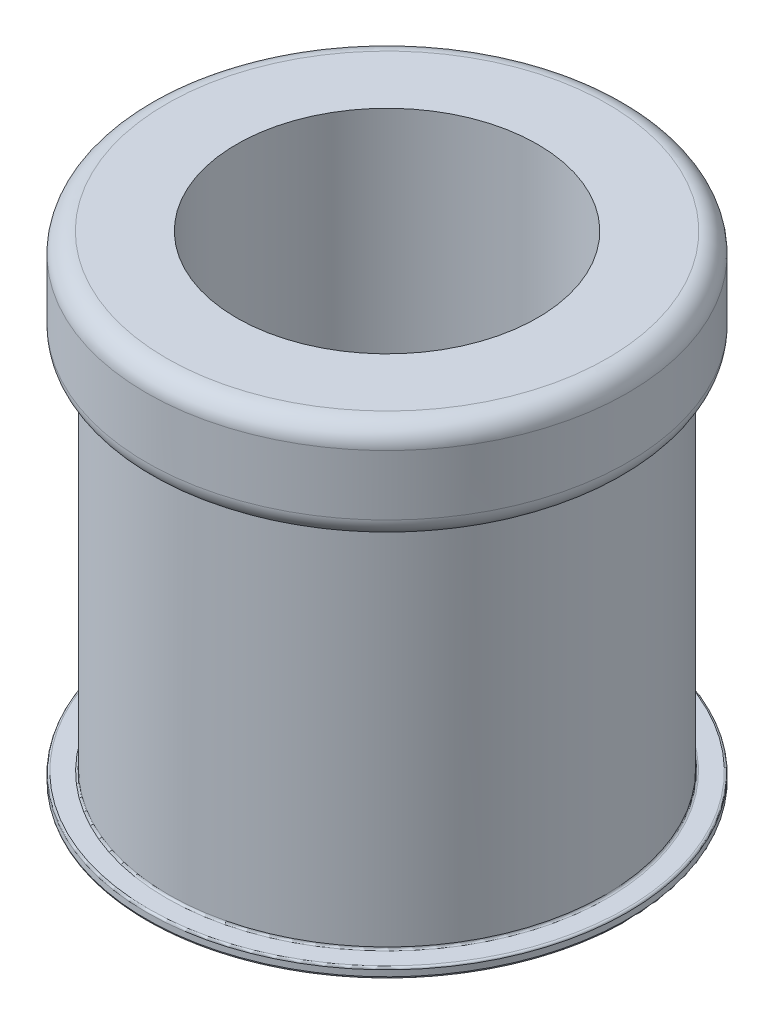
from build123d import *

# Parameters (mm, degrees)
FILLET1_R          = 1.27
SKETCH2_R          = 9.525
CUT_EXTRUDE1_DEPTH = 38.13338842
FILLET2_R          = 0.127


with BuildPart() as part:
    # Sketch1 → Revolve1 (revolve)
    with BuildSketch(Plane(origin=(0, 0, 0), x_dir=(0, 0, -1), z_dir=(1, 0, 0))):
        Polygon((0, 0), (15.2273, 0), (15.2273, 0.635), (13.818437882, 0.635), (13.818437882, 23.9014), (15.2273, 23.9014), (15.2273, 30.2514), (0, 30.2514), align=None)
    revolve(axis=Axis((0, 0, 0), (0, 1, 0)))

    # Fillet1
    fillet1_edges = [part.edges().sort_by_distance(p)[0] for p in [
        (0, 30.2514, 15.2273),
        (0, 23.9014, 15.2273),
    ]]
    fillet(fillet1_edges, radius=FILLET1_R)

    # Sketch2 → Cut-Extrude1 (cut, through all)
    with BuildSketch(Plane(origin=(0, 30.2514, 0), x_dir=(-1, 0, 0), z_dir=(0, 1, 0))):
        with Locations(Location((0, 0, 0), (0, 0, 90))):
            Circle(SKETCH2_R)
    extrude(amount=-CUT_EXTRUDE1_DEPTH, mode=Mode.SUBTRACT)

    # Fillet2
    fillet2_edges = [part.edges().sort_by_distance(p)[0] for p in [
        (0, 0.635, 13.818437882),
        (0, 0.635, 15.2273),
        (0, 0, 15.2273),
    ]]
    fillet(fillet2_edges, radius=FILLET2_R)


solid = part.part
